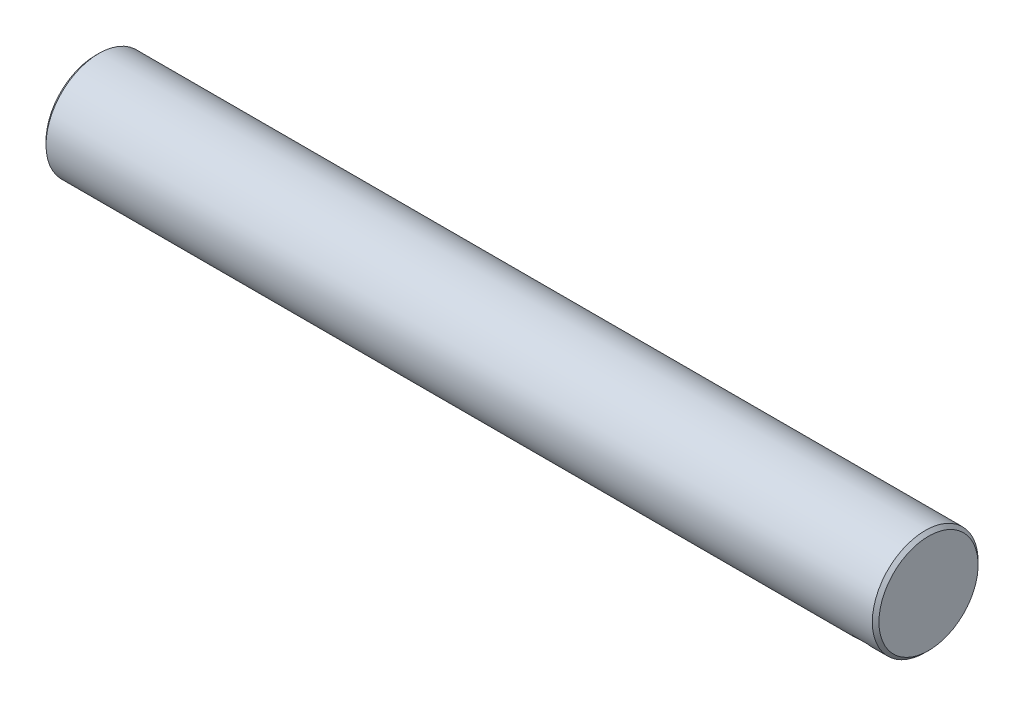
ISO-10303-21;
HEADER;
FILE_DESCRIPTION(('STEP AP214'),'2;1');
FILE_NAME('part.step','',(''),(''),'','','');
FILE_SCHEMA(('AUTOMOTIVE_DESIGN { 1 0 10303 214 1 1 1 1 }'));
ENDSEC;
DATA;
#1=APPLICATION_CONTEXT('core data for automotive mechanical design processes');
#2=APPLICATION_PROTOCOL_DEFINITION('international standard','automotive_design',2000,#1);
#3=PRODUCT_CONTEXT('',#1,'mechanical');
#4=PRODUCT('Part','Part','',(#3));
#5=PRODUCT_RELATED_PRODUCT_CATEGORY('part','',(#4));
#6=PRODUCT_DEFINITION_FORMATION('','',#4);
#7=PRODUCT_DEFINITION_CONTEXT('part definition',#1,'design');
#8=PRODUCT_DEFINITION('design','',#6,#7);
#9=PRODUCT_DEFINITION_SHAPE('','',#8);
#10=(LENGTH_UNIT() NAMED_UNIT(*) SI_UNIT(.MILLI.,.METRE.));
#11=(NAMED_UNIT(*) PLANE_ANGLE_UNIT() SI_UNIT($,.RADIAN.));
#12=(NAMED_UNIT(*) SI_UNIT($,.STERADIAN.) SOLID_ANGLE_UNIT());
#13=UNCERTAINTY_MEASURE_WITH_UNIT(LENGTH_MEASURE(1.E-05),#10,'distance_accuracy_value','');
#14=(GEOMETRIC_REPRESENTATION_CONTEXT(3) GLOBAL_UNCERTAINTY_ASSIGNED_CONTEXT((#13)) GLOBAL_UNIT_ASSIGNED_CONTEXT((#10,
#11,#12)) REPRESENTATION_CONTEXT('',''));
#15=CARTESIAN_POINT('',(0.,0.,0.));
#16=DIRECTION('',(0.,0.,1.));
#17=DIRECTION('',(1.,0.,0.));
#18=AXIS2_PLACEMENT_3D('',#15,#16,#17);
#19=CARTESIAN_POINT('',(63.,8.00000000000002,0.));
#20=DIRECTION('',(-1.,0.,0.));
#21=DIRECTION('',(0.,0.,1.));
#22=AXIS2_PLACEMENT_3D('',#19,#20,#21);
#23=PLANE('',#22);
#24=CARTESIAN_POINT('',(63.,0.,0.));
#25=DIRECTION('',(-1.,0.,0.));
#26=DIRECTION('',(0.,0.,1.));
#27=AXIS2_PLACEMENT_3D('',#24,#25,#26);
#28=CIRCLE('',#27,7.49999999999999);
#29=CARTESIAN_POINT('',(63.,0.,7.49999999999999));
#30=VERTEX_POINT('',#29);
#31=EDGE_CURVE('E19',#30,#30,#28,.T.);
#32=ORIENTED_EDGE('',*,*,#31,.F.);
#33=EDGE_LOOP('',(#32));
#34=FACE_BOUND('',#33,.T.);
#35=ADVANCED_FACE('F16',(#34),#23,.F.);
#36=CARTESIAN_POINT('',(-63.,8.,0.));
#37=DIRECTION('',(1.,0.,0.));
#38=DIRECTION('',(0.,0.,-1.));
#39=AXIS2_PLACEMENT_3D('',#36,#37,#38);
#40=PLANE('',#39);
#41=CARTESIAN_POINT('',(-63.,0.,0.));
#42=DIRECTION('',(1.,0.,0.));
#43=DIRECTION('',(0.,1.,0.));
#44=AXIS2_PLACEMENT_3D('',#41,#42,#43);
#45=CIRCLE('',#44,7.49999999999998);
#46=CARTESIAN_POINT('',(-63.,7.49999999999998,0.));
#47=VERTEX_POINT('',#46);
#48=EDGE_CURVE('E57',#47,#47,#45,.T.);
#49=ORIENTED_EDGE('',*,*,#48,.F.);
#50=EDGE_LOOP('',(#49));
#51=FACE_BOUND('',#50,.T.);
#52=ADVANCED_FACE('F73',(#51),#40,.F.);
#53=CARTESIAN_POINT('',(57.5,-5.,-10.));
#54=DIRECTION('',(-1.,0.,0.));
#55=DIRECTION('',(0.,0.,1.));
#56=AXIS2_PLACEMENT_3D('',#53,#54,#55);
#57=PLANE('',#56);
#58=CARTESIAN_POINT('',(57.5,0.,0.));
#59=DIRECTION('',(-1.,0.,0.));
#60=DIRECTION('',(0.,0.,1.));
#61=AXIS2_PLACEMENT_3D('',#58,#59,#60);
#62=CIRCLE('',#61,8.00000000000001);
#63=CARTESIAN_POINT('',(57.5,-5.,-6.24499799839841));
#64=VERTEX_POINT('',#63);
#65=CARTESIAN_POINT('',(57.5,-5.,6.24499799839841));
#66=VERTEX_POINT('',#65);
#67=EDGE_CURVE('E50',#64,#66,#62,.T.);
#68=ORIENTED_EDGE('',*,*,#67,.F.);
#69=DIRECTION('',(0.,0.,1.));
#70=VECTOR('',#69,1.);
#71=CARTESIAN_POINT('',(57.5,-5.,-10.));
#72=LINE('',#71,#70);
#73=EDGE_CURVE('E40',#64,#66,#72,.T.);
#74=ORIENTED_EDGE('',*,*,#73,.T.);
#75=EDGE_LOOP('',(#68,#74));
#76=FACE_BOUND('',#75,.T.);
#77=ADVANCED_FACE('F51',(#76),#57,.F.);
#78=CARTESIAN_POINT('',(57.5,-5.,-10.));
#79=DIRECTION('',(0.,1.,0.));
#80=DIRECTION('',(0.,0.,1.));
#81=AXIS2_PLACEMENT_3D('',#78,#79,#80);
#82=PLANE('',#81);
#83=DIRECTION('',(-1.,0.,0.));
#84=VECTOR('',#83,1.);
#85=CARTESIAN_POINT('',(-140.464918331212,-5.,6.24499799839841));
#86=LINE('',#85,#84);
#87=CARTESIAN_POINT('',(60.,-5.,6.24499799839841));
#88=VERTEX_POINT('',#87);
#89=EDGE_CURVE('E46',#66,#88,#86,.F.);
#90=ORIENTED_EDGE('',*,*,#89,.F.);
#91=ORIENTED_EDGE('',*,*,#73,.F.);
#92=DIRECTION('',(-1.,0.,0.));
#93=VECTOR('',#92,1.);
#94=CARTESIAN_POINT('',(-140.464918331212,-5.,-6.24499799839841));
#95=LINE('',#94,#93);
#96=CARTESIAN_POINT('',(60.,-5.,-6.24499799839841));
#97=VERTEX_POINT('',#96);
#98=EDGE_CURVE('E44',#97,#64,#95,.T.);
#99=ORIENTED_EDGE('',*,*,#98,.F.);
#100=DIRECTION('',(0.,0.,-1.));
#101=VECTOR('',#100,1.);
#102=CARTESIAN_POINT('',(60.,-5.,-10.));
#103=LINE('',#102,#101);
#104=EDGE_CURVE('E33',#97,#88,#103,.F.);
#105=ORIENTED_EDGE('',*,*,#104,.T.);
#106=EDGE_LOOP('',(#90,#91,#99,#105));
#107=FACE_BOUND('',#106,.T.);
#108=ADVANCED_FACE('F42',(#107),#82,.F.);
#109=CARTESIAN_POINT('',(60.,-5.,-10.));
#110=DIRECTION('',(1.,0.,0.));
#111=DIRECTION('',(0.,0.,-1.));
#112=AXIS2_PLACEMENT_3D('',#109,#110,#111);
#113=PLANE('',#112);
#114=CARTESIAN_POINT('',(60.,0.,0.));
#115=DIRECTION('',(-1.,0.,0.));
#116=DIRECTION('',(0.,0.,1.));
#117=AXIS2_PLACEMENT_3D('',#114,#115,#116);
#118=CIRCLE('',#117,8.00000000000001);
#119=EDGE_CURVE('E56',#88,#97,#118,.F.);
#120=ORIENTED_EDGE('',*,*,#119,.F.);
#121=ORIENTED_EDGE('',*,*,#104,.F.);
#122=EDGE_LOOP('',(#120,#121));
#123=FACE_BOUND('',#122,.T.);
#124=ADVANCED_FACE('F92',(#123),#113,.F.);
#125=CARTESIAN_POINT('',(62.5,0.,0.));
#126=DIRECTION('',(-1.,0.,0.));
#127=DIRECTION('',(0.,0.,1.));
#128=AXIS2_PLACEMENT_3D('',#125,#126,#127);
#129=CONICAL_SURFACE('',#128,8.00000000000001,0.785398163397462);
#130=CARTESIAN_POINT('',(62.5,0.,0.));
#131=DIRECTION('',(-1.,0.,0.));
#132=DIRECTION('',(0.,0.,1.));
#133=AXIS2_PLACEMENT_3D('',#130,#131,#132);
#134=CIRCLE('',#133,8.00000000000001);
#135=CARTESIAN_POINT('',(62.5,0.,8.00000000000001));
#136=VERTEX_POINT('',#135);
#137=EDGE_CURVE('E25',#136,#136,#134,.T.);
#138=ORIENTED_EDGE('',*,*,#137,.F.);
#139=EDGE_LOOP('',(#138));
#140=FACE_BOUND('',#139,.T.);
#141=ORIENTED_EDGE('',*,*,#31,.T.);
#142=EDGE_LOOP('',(#141));
#143=FACE_BOUND('',#142,.T.);
#144=ADVANCED_FACE('F70',(#140,#143),#129,.T.);
#145=CARTESIAN_POINT('',(-62.5,0.,0.));
#146=DIRECTION('',(1.,0.,0.));
#147=DIRECTION('',(0.,1.,0.));
#148=AXIS2_PLACEMENT_3D('',#145,#146,#147);
#149=CONICAL_SURFACE('',#148,8.00000000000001,0.785398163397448);
#150=CARTESIAN_POINT('',(-62.5,0.,0.));
#151=DIRECTION('',(-1.,0.,0.));
#152=DIRECTION('',(0.,0.,1.));
#153=AXIS2_PLACEMENT_3D('',#150,#151,#152);
#154=CIRCLE('',#153,8.00000000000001);
#155=CARTESIAN_POINT('',(-62.5,0.,8.00000000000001));
#156=VERTEX_POINT('',#155);
#157=EDGE_CURVE('E11',#156,#156,#154,.F.);
#158=ORIENTED_EDGE('',*,*,#157,.F.);
#159=EDGE_LOOP('',(#158));
#160=FACE_BOUND('',#159,.T.);
#161=ORIENTED_EDGE('',*,*,#48,.T.);
#162=EDGE_LOOP('',(#161));
#163=FACE_BOUND('',#162,.T.);
#164=ADVANCED_FACE('F80',(#160,#163),#149,.T.);
#165=CARTESIAN_POINT('',(-140.464918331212,0.,0.));
#166=DIRECTION('',(-1.,0.,0.));
#167=DIRECTION('',(0.,0.,1.));
#168=AXIS2_PLACEMENT_3D('',#165,#166,#167);
#169=CYLINDRICAL_SURFACE('',#168,8.00000000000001);
#170=ORIENTED_EDGE('',*,*,#157,.T.);
#171=EDGE_LOOP('',(#170));
#172=FACE_BOUND('',#171,.T.);
#173=ORIENTED_EDGE('',*,*,#137,.T.);
#174=EDGE_LOOP('',(#173));
#175=FACE_BOUND('',#174,.T.);
#176=ORIENTED_EDGE('',*,*,#89,.T.);
#177=ORIENTED_EDGE('',*,*,#119,.T.);
#178=ORIENTED_EDGE('',*,*,#98,.T.);
#179=ORIENTED_EDGE('',*,*,#67,.T.);
#180=EDGE_LOOP('',(#176,#177,#178,#179));
#181=FACE_BOUND('',#180,.T.);
#182=ADVANCED_FACE('F55',(#172,#175,#181),#169,.T.);
#183=CLOSED_SHELL('',(#35,#52,#77,#108,#124,#144,#164,#182));
#184=MANIFOLD_SOLID_BREP('B1',#183);
#185=ADVANCED_BREP_SHAPE_REPRESENTATION('',(#18,#184),#14);
#186=SHAPE_DEFINITION_REPRESENTATION(#9,#185);
ENDSEC;
END-ISO-10303-21;
